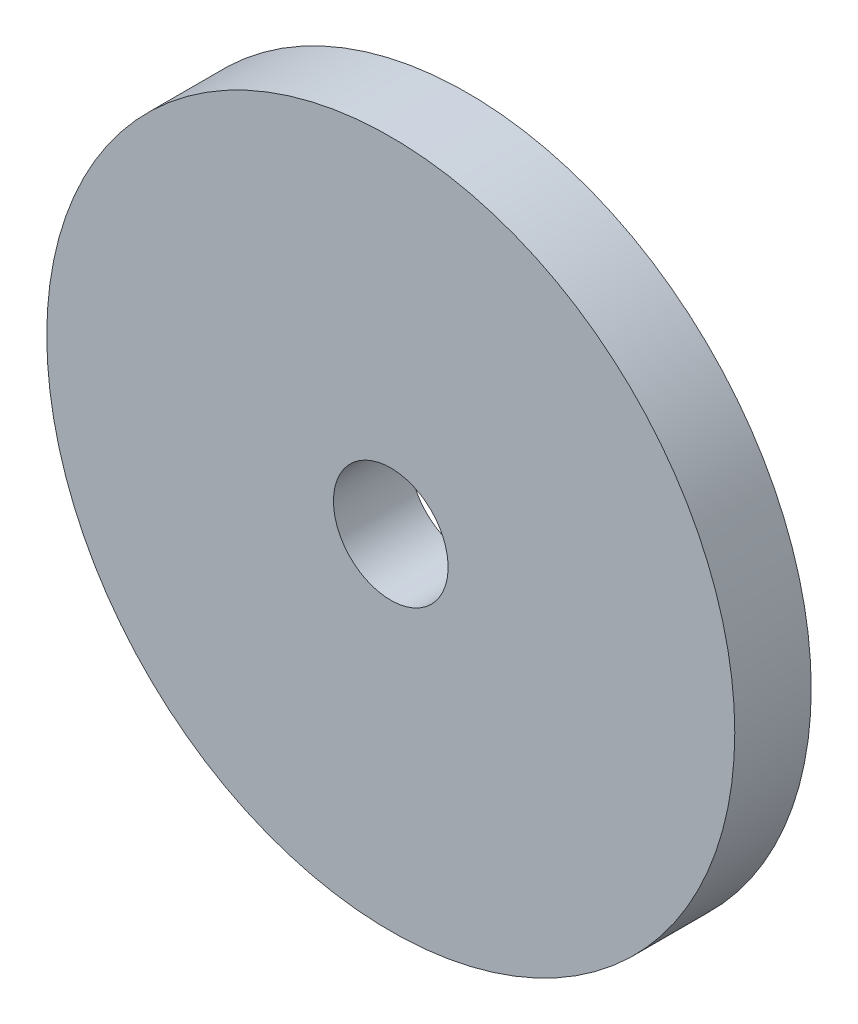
from build123d import *

# Parameters (mm, degrees)
SKETCH_1_R          = 18
EXTRUDE_1_DEPTH     = 4
SKETCH_2_R          = 3
CUT_EXTRUDE_1_DEPTH = 4


with BuildPart() as part:
    # Sketch 1 → Extrude 1 (new body)
    with BuildSketch(Plane.XY):
        Circle(SKETCH_1_R)
    extrude(amount=EXTRUDE_1_DEPTH)

    # Sketch 2 → Cut-Extrude 1 (cut)
    with BuildSketch(Plane(origin=(0, 0, 0), x_dir=(-1, 0, 0), z_dir=(0, 0, -1))):
        Circle(SKETCH_2_R)
    extrude(amount=-CUT_EXTRUDE_1_DEPTH, mode=Mode.SUBTRACT)


solid = part.part
